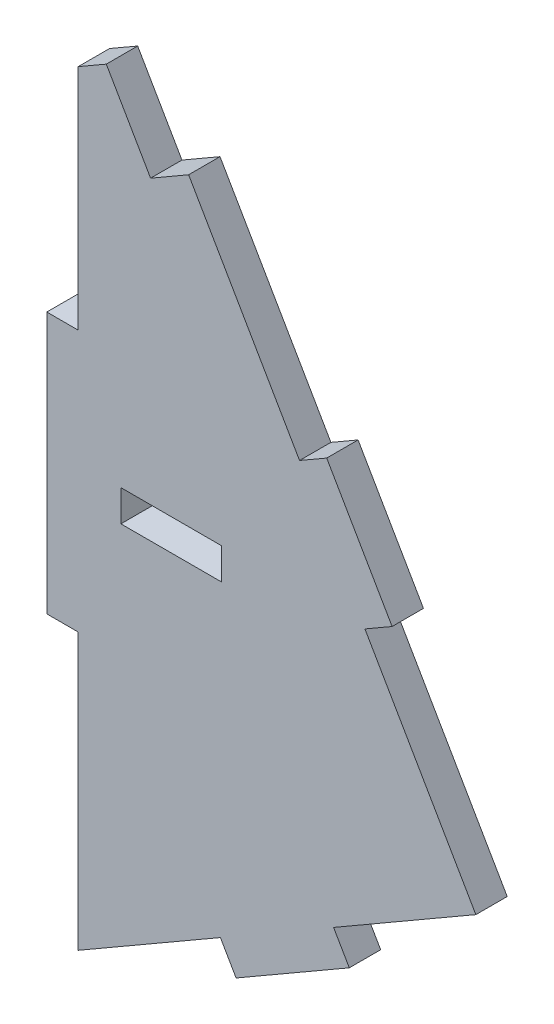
from build123d import *

# Parameters (mm, degrees)
SKETCH1_W           = 4.895729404
SKETCH1_H           = 1.524
BOSS_EXTRUDE1_DEPTH = 1.524


with BuildPart() as part:
    # Sketch1 → Boss-Extrude1 (new body)
    with BuildSketch(Plane.XY):
        Polygon((1.524, -7.868951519), (0, -7.868951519), (0, 4.831048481), (1.524, 4.831048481), (1.524, 15.91575057), (2.890809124, 16.705361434), (5.041682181, 12.982220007), (6.890158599, 14.05009191), (12.277877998, 4.723999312), (13.597498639, 5.486349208), (16.77395654, -0.012070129), (15.454335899, -0.774420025), (20.842055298, -10.100512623), (13.932237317, -14.092340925), (14.694587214, -15.411961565), (9.196167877, -18.588419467), (8.433817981, -17.268798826), (1.524, -21.260627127), align=None)
        with Locations((6.04741362, -1.518951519)):
            Rectangle(SKETCH1_W, SKETCH1_H, mode=Mode.SUBTRACT)
    extrude(amount=BOSS_EXTRUDE1_DEPTH)


solid = part.part
